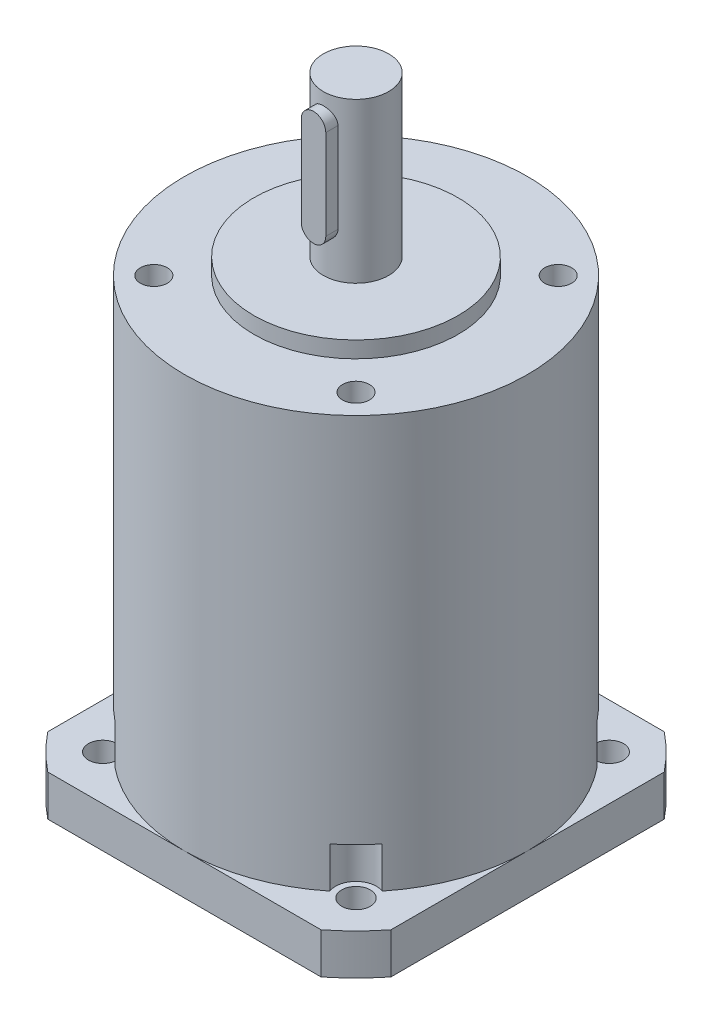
from build123d import *

# Parameters (mm, degrees)
SKETCH_1_R             = 21
EXTRUDE_1_DEPTH        = 50.5
SKETCH_2_R             = 12.5
EXTRUDE_2_DEPTH        = 2
SKETCH_3_R             = 4
EXTRUDE_3_DEPTH        = 21.5
HOLE_WIZARD_M4_1_D     = 3.3
HOLE_WIZARD_M4_1_DEPTH = 9
HOLE_WIZARD_M4_1_TIP   = 0.991420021
EXTRUDE_4_DEPTH        = 3
SKETCH_8_W             = 42
SKETCH_8_H             = 42
EXTRUDE_5_DEPTH        = 5
SKETCH_10_R            = 30.265542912
SKETCH_10_R_2          = 26.85
CUT_EXTRUDE_2_DEPTH    = 5.5
SKETCH_11_R            = 11
CUT_EXTRUDE_3_DEPTH    = 2.5
SKETCH_12_R            = 2.5
CUT_EXTRUDE_4_DEPTH    = 10
SKETCH_13_R            = 1.75
CUT_EXTRUDE_5_DEPTH    = 10
SKETCH_14_R            = 2.5
CUT_EXTRUDE_6_DEPTH    = 5


with BuildPart() as part:
    # Sketch 1 → Extrude 1 (new body)
    with BuildSketch(Plane(origin=(0, 0, 0), x_dir=(1, 0, 0), z_dir=(0, 1, 0))):
        with Locations(Location((0, 0, 0), (0, 0, 270))):
            Circle(SKETCH_1_R)
    extrude(amount=EXTRUDE_1_DEPTH)

    # Sketch 2 → Extrude 2 (add)
    with BuildSketch(Plane(origin=(0, 50.5, 0), x_dir=(1, 0, 0), z_dir=(0, 1, 0))):
        with Locations(Location((0, 0, 0), (0, 0, 270))):
            Circle(SKETCH_2_R)
    extrude(amount=EXTRUDE_2_DEPTH)

    # Sketch 3 → Extrude 3 (add)
    with BuildSketch(Plane(origin=(0, 50.5, 0), x_dir=(1, 0, 0), z_dir=(0, 1, 0))):
        with Locations(Location((0, 0, 0), (0, 0, 270))):
            Circle(SKETCH_3_R)
    extrude(amount=EXTRUDE_3_DEPTH)

    # Hole Wizard M4 _1
    with Locations(Plane(origin=(0, 50.5, 0), x_dir=(1, 0, 0), z_dir=(0, 1, 0))):
        with Locations((-12.374368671, 12.374368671), (-12.374368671, -12.374368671), (12.374368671, -12.374368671), (12.374368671, 12.374368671)):
            Hole(HOLE_WIZARD_M4_1_D / 2, depth=HOLE_WIZARD_M4_1_DEPTH)
            with Locations((0, 0, -(HOLE_WIZARD_M4_1_DEPTH + HOLE_WIZARD_M4_1_TIP / 2))):  # 118° drill point
                Cone(0, HOLE_WIZARD_M4_1_D / 2, HOLE_WIZARD_M4_1_TIP, mode=Mode.SUBTRACT)

    # Sketch 7 → Extrude 4 (add)
    with BuildSketch(Plane.XY.offset(2.2)):
        with BuildLine():
            Line((-1.5, 69), (-1.5, 58))
            ThreePointArc((-1.5, 58), (0, 56.5), (1.5, 58))
            Line((1.5, 58), (1.5, 69))
            ThreePointArc((1.5, 69), (0, 70.5), (-1.5, 69))
        make_face()
    extrude(amount=EXTRUDE_4_DEPTH)

    # Sketch 8 → Extrude 5 (add)
    with BuildSketch(Plane(origin=(0, 0, 0), x_dir=(1, 0, 0), z_dir=(0, 1, 0))):
        Rectangle(SKETCH_8_W, SKETCH_8_H)
    extrude(amount=-EXTRUDE_5_DEPTH)

    # Sketch 10 → Cut-Extrude 2 (cut)
    with BuildSketch(Plane(origin=(0, 0, 0), x_dir=(1, 0, 0), z_dir=(0, 1, 0))):
        Circle(SKETCH_10_R)
        Circle(SKETCH_10_R_2, mode=Mode.SUBTRACT)
    extrude(amount=-CUT_EXTRUDE_2_DEPTH, mode=Mode.SUBTRACT)

    # Sketch 11 → Cut-Extrude 3 (cut)
    with BuildSketch(Plane(origin=(0, -5, 0), x_dir=(-1, 0, 0), z_dir=(0, -1, 0))):
        with Locations(Location((0, 0, 0), (0, 0, 90))):
            Circle(SKETCH_11_R)
    extrude(amount=-CUT_EXTRUDE_3_DEPTH, mode=Mode.SUBTRACT)

    # Sketch 12 → Cut-Extrude 4 (cut)
    with BuildSketch(Plane(origin=(0, -5, 0), x_dir=(-1, 0, 0), z_dir=(0, -1, 0))):
        with Locations(Location((0, 0, 0), (0, 0, 90))):
            Circle(SKETCH_12_R)
    extrude(amount=-CUT_EXTRUDE_4_DEPTH, mode=Mode.SUBTRACT)

    # Sketch 13 → Cut-Extrude 5 (cut)
    with BuildSketch(Plane(origin=(0, -5, 0), x_dir=(-1, 0, 0), z_dir=(0, -1, 0))):
        with Locations(Location((-15.5, -15.5, 0), (0, 0, 90))):
            Circle(SKETCH_13_R)
        with Locations(Location((-15.5, 15.5, 0), (0, 0, 90))):
            Circle(SKETCH_13_R)
        with Locations(Location((15.5, 15.5, 0), (0, 0, 90))):
            Circle(SKETCH_13_R)
        with Locations(Location((15.5, -15.5, 0), (0, 0, 90))):
            Circle(SKETCH_13_R)
    extrude(amount=-CUT_EXTRUDE_5_DEPTH, mode=Mode.SUBTRACT)

    # Sketch 14 → Cut-Extrude 6 (cut)
    with BuildSketch(Plane(origin=(0, 0, 0), x_dir=(1, 0, 0), z_dir=(0, 1, 0))):
        with Locations((15.5, -15.5)):
            Circle(SKETCH_14_R)
        with Locations((-15.5, -15.5)):
            Circle(SKETCH_14_R)
        with Locations((-15.5, 15.5)):
            Circle(SKETCH_14_R)
        with Locations((15.5, 15.5)):
            Circle(SKETCH_14_R)
    extrude(amount=CUT_EXTRUDE_6_DEPTH, mode=Mode.SUBTRACT)


solid = part.part
